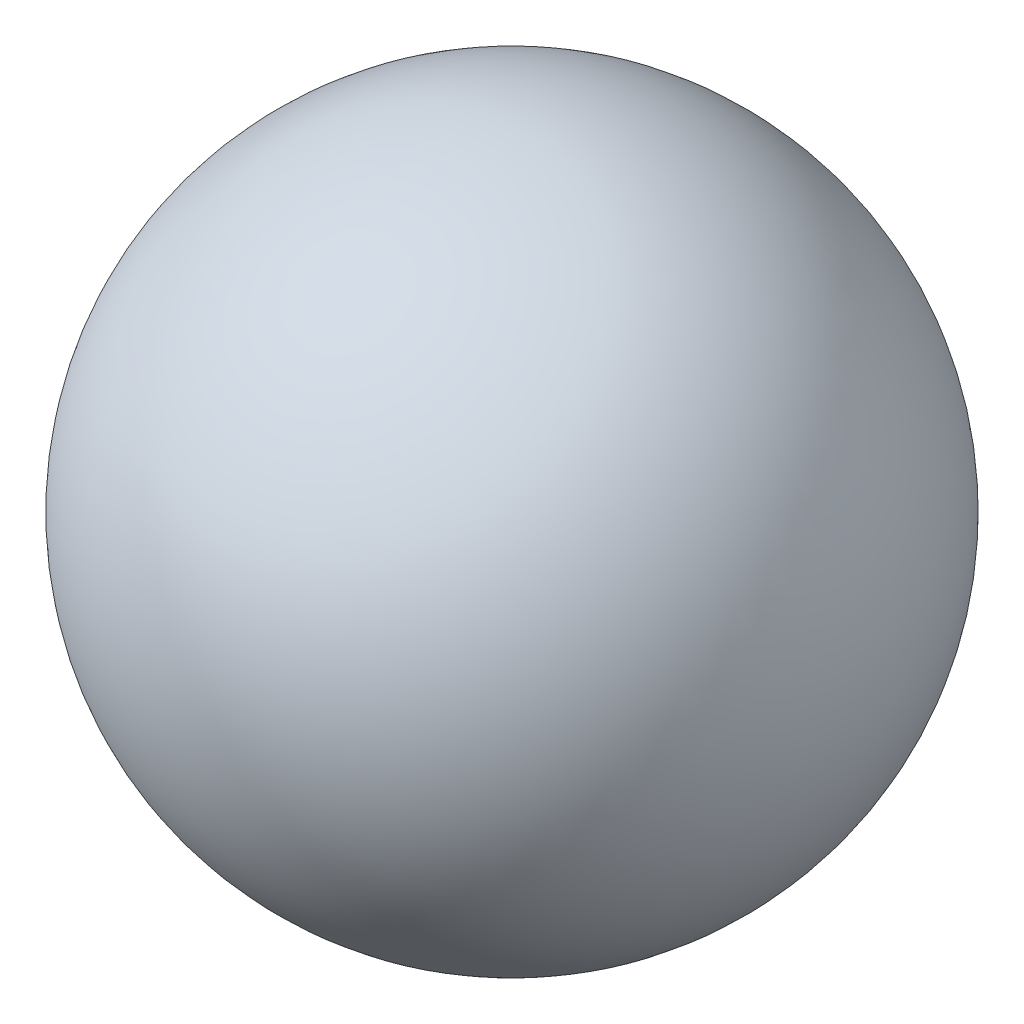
ISO-10303-21;
HEADER;
FILE_DESCRIPTION(('STEP AP214'),'2;1');
FILE_NAME('part.step','',(''),(''),'','','');
FILE_SCHEMA(('AUTOMOTIVE_DESIGN { 1 0 10303 214 1 1 1 1 }'));
ENDSEC;
DATA;
#1=APPLICATION_CONTEXT('core data for automotive mechanical design processes');
#2=APPLICATION_PROTOCOL_DEFINITION('international standard','automotive_design',2000,#1);
#3=PRODUCT_CONTEXT('',#1,'mechanical');
#4=PRODUCT('Part','Part','',(#3));
#5=PRODUCT_RELATED_PRODUCT_CATEGORY('part','',(#4));
#6=PRODUCT_DEFINITION_FORMATION('','',#4);
#7=PRODUCT_DEFINITION_CONTEXT('part definition',#1,'design');
#8=PRODUCT_DEFINITION('design','',#6,#7);
#9=PRODUCT_DEFINITION_SHAPE('','',#8);
#10=(LENGTH_UNIT() NAMED_UNIT(*) SI_UNIT(.MILLI.,.METRE.));
#11=(NAMED_UNIT(*) PLANE_ANGLE_UNIT() SI_UNIT($,.RADIAN.));
#12=(NAMED_UNIT(*) SI_UNIT($,.STERADIAN.) SOLID_ANGLE_UNIT());
#13=UNCERTAINTY_MEASURE_WITH_UNIT(LENGTH_MEASURE(1.E-05),#10,'distance_accuracy_value','');
#14=(GEOMETRIC_REPRESENTATION_CONTEXT(3) GLOBAL_UNCERTAINTY_ASSIGNED_CONTEXT((#13)) GLOBAL_UNIT_ASSIGNED_CONTEXT((#10,
#11,#12)) REPRESENTATION_CONTEXT('',''));
#15=CARTESIAN_POINT('',(0.,0.,0.));
#16=DIRECTION('',(0.,0.,1.));
#17=DIRECTION('',(1.,0.,0.));
#18=AXIS2_PLACEMENT_3D('',#15,#16,#17);
#19=CARTESIAN_POINT('',(0.,0.,0.));
#20=DIRECTION('',(0.,-1.,0.));
#21=DIRECTION('',(1.,0.,0.));
#22=AXIS2_PLACEMENT_3D('',#19,#20,#21);
#23=SPHERICAL_SURFACE('',#22,64.6093189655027);
#24=CARTESIAN_POINT('',(0.,-64.6093189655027,0.));
#25=VERTEX_POINT('',#24);
#26=VERTEX_LOOP('',#25);
#27=FACE_BOUND('',#26,.T.);
#28=ADVANCED_FACE('F29',(#27),#23,.T.);
#29=CLOSED_SHELL('',(#28));
#30=MANIFOLD_SOLID_BREP('B2',#29);
#31=ADVANCED_BREP_SHAPE_REPRESENTATION('',(#18,#30),#14);
#32=SHAPE_DEFINITION_REPRESENTATION(#9,#31);
ENDSEC;
END-ISO-10303-21;
